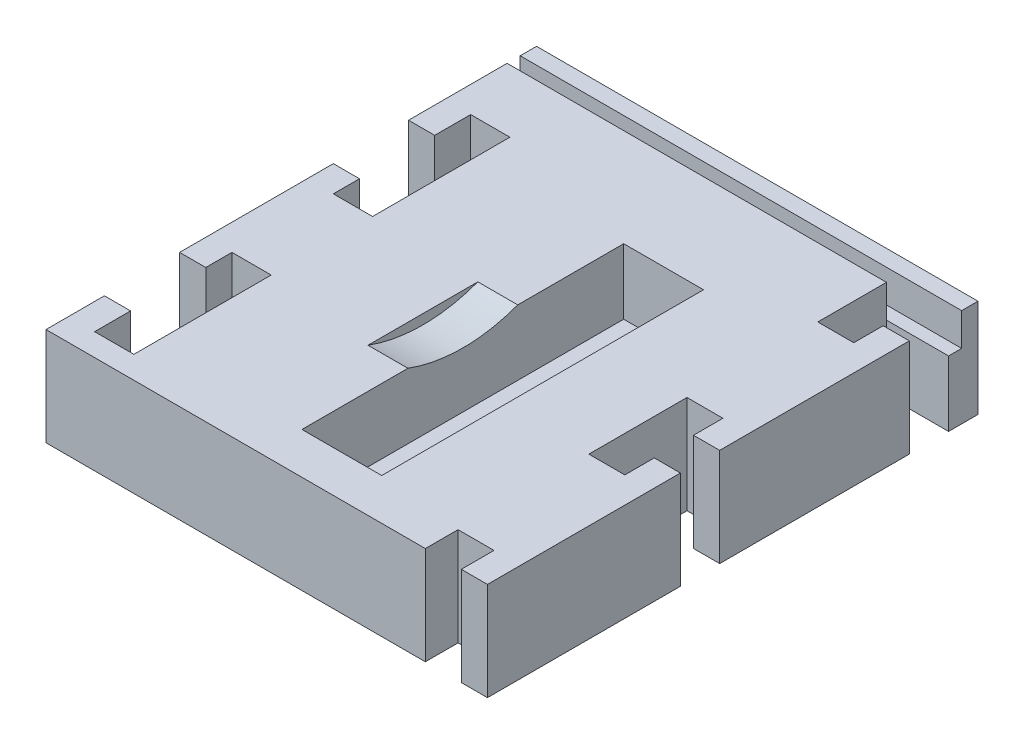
ISO-10303-21;
HEADER;
FILE_DESCRIPTION(('STEP AP214'),'2;1');
FILE_NAME('part.step','',(''),(''),'','','');
FILE_SCHEMA(('AUTOMOTIVE_DESIGN { 1 0 10303 214 1 1 1 1 }'));
ENDSEC;
DATA;
#1=APPLICATION_CONTEXT('core data for automotive mechanical design processes');
#2=APPLICATION_PROTOCOL_DEFINITION('international standard','automotive_design',2000,#1);
#3=PRODUCT_CONTEXT('',#1,'mechanical');
#4=PRODUCT('Part','Part','',(#3));
#5=PRODUCT_RELATED_PRODUCT_CATEGORY('part','',(#4));
#6=PRODUCT_DEFINITION_FORMATION('','',#4);
#7=PRODUCT_DEFINITION_CONTEXT('part definition',#1,'design');
#8=PRODUCT_DEFINITION('design','',#6,#7);
#9=PRODUCT_DEFINITION_SHAPE('','',#8);
#10=(LENGTH_UNIT() NAMED_UNIT(*) SI_UNIT(.MILLI.,.METRE.));
#11=(NAMED_UNIT(*) PLANE_ANGLE_UNIT() SI_UNIT($,.RADIAN.));
#12=(NAMED_UNIT(*) SI_UNIT($,.STERADIAN.) SOLID_ANGLE_UNIT());
#13=UNCERTAINTY_MEASURE_WITH_UNIT(LENGTH_MEASURE(1.E-05),#10,'distance_accuracy_value','');
#14=(GEOMETRIC_REPRESENTATION_CONTEXT(3) GLOBAL_UNCERTAINTY_ASSIGNED_CONTEXT((#13)) GLOBAL_UNIT_ASSIGNED_CONTEXT((#10,
#11,#12)) REPRESENTATION_CONTEXT('',''));
#15=CARTESIAN_POINT('',(0.,0.,0.));
#16=DIRECTION('',(0.,0.,1.));
#17=DIRECTION('',(1.,0.,0.));
#18=AXIS2_PLACEMENT_3D('',#15,#16,#17);
#19=CARTESIAN_POINT('',(0.,15.,0.));
#20=DIRECTION('',(0.,1.,0.));
#21=DIRECTION('',(0.,0.,1.));
#22=AXIS2_PLACEMENT_3D('',#19,#20,#21);
#23=PLANE('',#22);
#24=DIRECTION('',(-1.,0.,0.));
#25=VECTOR('',#24,1.);
#26=CARTESIAN_POINT('',(0.,15.,75.002781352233));
#27=LINE('',#26,#25);
#28=CARTESIAN_POINT('',(58.,15.,75.002781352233));
#29=VERTEX_POINT('',#28);
#30=CARTESIAN_POINT('',(0.,15.,75.002781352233));
#31=VERTEX_POINT('',#30);
#32=EDGE_CURVE('E336',#29,#31,#27,.T.);
#33=ORIENTED_EDGE('',*,*,#32,.F.);
#34=DIRECTION('',(0.,0.,-1.));
#35=VECTOR('',#34,1.);
#36=CARTESIAN_POINT('',(58.,15.,0.));
#37=LINE('',#36,#35);
#38=CARTESIAN_POINT('',(58.,15.,70.002781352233));
#39=VERTEX_POINT('',#38);
#40=EDGE_CURVE('E648',#29,#39,#37,.T.);
#41=ORIENTED_EDGE('',*,*,#40,.T.);
#42=DIRECTION('',(1.,0.,0.));
#43=VECTOR('',#42,1.);
#44=CARTESIAN_POINT('',(0.,15.,70.002781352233));
#45=LINE('',#44,#43);
#46=CARTESIAN_POINT('',(63.5,15.,70.002781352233));
#47=VERTEX_POINT('',#46);
#48=EDGE_CURVE('E558',#39,#47,#45,.T.);
#49=ORIENTED_EDGE('',*,*,#48,.T.);
#50=DIRECTION('',(0.,0.,1.));
#51=VECTOR('',#50,1.);
#52=CARTESIAN_POINT('',(63.5,15.,0.));
#53=LINE('',#52,#51);
#54=CARTESIAN_POINT('',(63.5,15.,75.002781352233));
#55=VERTEX_POINT('',#54);
#56=EDGE_CURVE('E561',#47,#55,#53,.T.);
#57=ORIENTED_EDGE('',*,*,#56,.T.);
#58=DIRECTION('',(1.,0.,0.));
#59=VECTOR('',#58,1.);
#60=CARTESIAN_POINT('',(0.,15.,75.002781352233));
#61=LINE('',#60,#59);
#62=CARTESIAN_POINT('',(67.5,15.,75.002781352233));
#63=VERTEX_POINT('',#62);
#64=EDGE_CURVE('E531',#55,#63,#61,.T.);
#65=ORIENTED_EDGE('',*,*,#64,.T.);
#66=DIRECTION('',(0.,0.,-1.));
#67=VECTOR('',#66,1.);
#68=CARTESIAN_POINT('',(67.5,15.,0.));
#69=LINE('',#68,#67);
#70=CARTESIAN_POINT('',(67.5,15.,45.5027813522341));
#71=VERTEX_POINT('',#70);
#72=EDGE_CURVE('E511',#63,#71,#69,.T.);
#73=ORIENTED_EDGE('',*,*,#72,.T.);
#74=DIRECTION('',(-1.,0.,-2.70616862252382E-13));
#75=VECTOR('',#74,1.);
#76=CARTESIAN_POINT('',(-1.23138199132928E-11,15.,45.5027813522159));
#77=LINE('',#76,#75);
#78=CARTESIAN_POINT('',(63.5,15.,45.502781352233));
#79=VERTEX_POINT('',#78);
#80=EDGE_CURVE('E550',#71,#79,#77,.T.);
#81=ORIENTED_EDGE('',*,*,#80,.T.);
#82=DIRECTION('',(0.,0.,-1.));
#83=VECTOR('',#82,1.);
#84=CARTESIAN_POINT('',(63.5,15.,0.));
#85=LINE('',#84,#83);
#86=CARTESIAN_POINT('',(63.5,15.,50.002781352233));
#87=VERTEX_POINT('',#86);
#88=EDGE_CURVE('E553',#87,#79,#85,.T.);
#89=ORIENTED_EDGE('',*,*,#88,.F.);
#90=DIRECTION('',(1.,0.,0.));
#91=VECTOR('',#90,1.);
#92=CARTESIAN_POINT('',(0.,15.,50.002781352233));
#93=LINE('',#92,#91);
#94=CARTESIAN_POINT('',(58.,15.,50.002781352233));
#95=VERTEX_POINT('',#94);
#96=EDGE_CURVE('E556',#95,#87,#93,.T.);
#97=ORIENTED_EDGE('',*,*,#96,.F.);
#98=CARTESIAN_POINT('',(58.,15.,35.));
#99=VERTEX_POINT('',#98);
#100=EDGE_CURVE('E649',#95,#99,#37,.T.);
#101=ORIENTED_EDGE('',*,*,#100,.T.);
#102=DIRECTION('',(-1.,0.,0.));
#103=VECTOR('',#102,1.);
#104=CARTESIAN_POINT('',(0.,15.,35.));
#105=LINE('',#104,#103);
#106=CARTESIAN_POINT('',(63.5,15.,35.));
#107=VERTEX_POINT('',#106);
#108=EDGE_CURVE('E501',#107,#99,#105,.T.);
#109=ORIENTED_EDGE('',*,*,#108,.F.);
#110=DIRECTION('',(0.,0.,1.));
#111=VECTOR('',#110,1.);
#112=CARTESIAN_POINT('',(63.5,15.,0.));
#113=LINE('',#112,#111);
#114=CARTESIAN_POINT('',(63.5,15.,39.5));
#115=VERTEX_POINT('',#114);
#116=EDGE_CURVE('E504',#107,#115,#113,.T.);
#117=ORIENTED_EDGE('',*,*,#116,.T.);
#118=DIRECTION('',(1.,0.,0.));
#119=VECTOR('',#118,1.);
#120=CARTESIAN_POINT('',(0.,15.,39.5));
#121=LINE('',#120,#119);
#122=CARTESIAN_POINT('',(67.5,15.,39.5));
#123=VERTEX_POINT('',#122);
#124=EDGE_CURVE('E474',#115,#123,#121,.T.);
#125=ORIENTED_EDGE('',*,*,#124,.T.);
#126=DIRECTION('',(0.,0.,1.));
#127=VECTOR('',#126,1.);
#128=CARTESIAN_POINT('',(67.5,15.,0.));
#129=LINE('',#128,#127);
#130=CARTESIAN_POINT('',(67.5,15.,10.5));
#131=VERTEX_POINT('',#130);
#132=EDGE_CURVE('E465',#131,#123,#129,.T.);
#133=ORIENTED_EDGE('',*,*,#132,.F.);
#134=DIRECTION('',(-1.,0.,0.));
#135=VECTOR('',#134,1.);
#136=CARTESIAN_POINT('',(0.,15.,10.5));
#137=LINE('',#136,#135);
#138=CARTESIAN_POINT('',(63.5,15.,10.5));
#139=VERTEX_POINT('',#138);
#140=EDGE_CURVE('E493',#131,#139,#137,.T.);
#141=ORIENTED_EDGE('',*,*,#140,.T.);
#142=DIRECTION('',(0.,0.,-1.));
#143=VECTOR('',#142,1.);
#144=CARTESIAN_POINT('',(63.5,15.,0.));
#145=LINE('',#144,#143);
#146=CARTESIAN_POINT('',(63.5,15.,15.));
#147=VERTEX_POINT('',#146);
#148=EDGE_CURVE('E496',#147,#139,#145,.T.);
#149=ORIENTED_EDGE('',*,*,#148,.F.);
#150=DIRECTION('',(1.,0.,0.));
#151=VECTOR('',#150,1.);
#152=CARTESIAN_POINT('',(0.,15.,15.));
#153=LINE('',#152,#151);
#154=CARTESIAN_POINT('',(58.,15.,15.));
#155=VERTEX_POINT('',#154);
#156=EDGE_CURVE('E499',#155,#147,#153,.T.);
#157=ORIENTED_EDGE('',*,*,#156,.F.);
#158=CARTESIAN_POINT('',(58.,15.,4.5));
#159=VERTEX_POINT('',#158);
#160=EDGE_CURVE('E367',#155,#159,#37,.T.);
#161=ORIENTED_EDGE('',*,*,#160,.T.);
#162=DIRECTION('',(1.,0.,0.));
#163=VECTOR('',#162,1.);
#164=CARTESIAN_POINT('',(67.5,15.,4.5));
#165=LINE('',#164,#163);
#166=CARTESIAN_POINT('',(0.,15.,4.5));
#167=VERTEX_POINT('',#166);
#168=EDGE_CURVE('E375',#167,#159,#165,.T.);
#169=ORIENTED_EDGE('',*,*,#168,.F.);
#170=DIRECTION('',(0.,0.,1.));
#171=VECTOR('',#170,1.);
#172=CARTESIAN_POINT('',(0.,15.,0.));
#173=LINE('',#172,#171);
#174=CARTESIAN_POINT('',(0.,15.,19.5705115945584));
#175=VERTEX_POINT('',#174);
#176=EDGE_CURVE('E362',#167,#175,#173,.T.);
#177=ORIENTED_EDGE('',*,*,#176,.T.);
#178=DIRECTION('',(-1.,0.,0.));
#179=VECTOR('',#178,1.);
#180=CARTESIAN_POINT('',(4.,15.,19.5705115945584));
#181=LINE('',#180,#179);
#182=CARTESIAN_POINT('',(4.,15.,19.5705115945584));
#183=VERTEX_POINT('',#182);
#184=EDGE_CURVE('E373',#183,#175,#181,.T.);
#185=ORIENTED_EDGE('',*,*,#184,.F.);
#186=DIRECTION('',(0.,0.,1.));
#187=VECTOR('',#186,1.);
#188=CARTESIAN_POINT('',(4.,15.,14.0705115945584));
#189=LINE('',#188,#187);
#190=CARTESIAN_POINT('',(4.,15.,14.0705115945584));
#191=VERTEX_POINT('',#190);
#192=EDGE_CURVE('E387',#191,#183,#189,.T.);
#193=ORIENTED_EDGE('',*,*,#192,.F.);
#194=DIRECTION('',(-1.,0.,0.));
#195=VECTOR('',#194,1.);
#196=CARTESIAN_POINT('',(4.,15.,14.0705115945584));
#197=LINE('',#196,#195);
#198=CARTESIAN_POINT('',(10.,15.,14.0705115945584));
#199=VERTEX_POINT('',#198);
#200=EDGE_CURVE('E717',#199,#191,#197,.T.);
#201=ORIENTED_EDGE('',*,*,#200,.F.);
#202=DIRECTION('',(0.,0.,-1.));
#203=VECTOR('',#202,1.);
#204=CARTESIAN_POINT('',(10.,15.,14.0705115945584));
#205=LINE('',#204,#203);
#206=CARTESIAN_POINT('',(10.,15.,35.0705115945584));
#207=VERTEX_POINT('',#206);
#208=EDGE_CURVE('E714',#207,#199,#205,.T.);
#209=ORIENTED_EDGE('',*,*,#208,.F.);
#210=DIRECTION('',(1.,0.,0.));
#211=VECTOR('',#210,1.);
#212=CARTESIAN_POINT('',(4.00000000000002,15.,35.0705115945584));
#213=LINE('',#212,#211);
#214=CARTESIAN_POINT('',(4.00000000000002,15.,35.0705115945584));
#215=VERTEX_POINT('',#214);
#216=EDGE_CURVE('E711',#215,#207,#213,.T.);
#217=ORIENTED_EDGE('',*,*,#216,.F.);
#218=DIRECTION('',(0.,0.,1.));
#219=VECTOR('',#218,1.);
#220=CARTESIAN_POINT('',(4.00000000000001,15.,29.5705115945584));
#221=LINE('',#220,#219);
#222=CARTESIAN_POINT('',(4.00000000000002,15.,31.0705115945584));
#223=VERTEX_POINT('',#222);
#224=EDGE_CURVE('E695',#223,#215,#221,.T.);
#225=ORIENTED_EDGE('',*,*,#224,.F.);
#226=DIRECTION('',(1.,0.,0.));
#227=VECTOR('',#226,1.);
#228=CARTESIAN_POINT('',(4.00000000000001,15.,31.0705115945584));
#229=LINE('',#228,#227);
#230=CARTESIAN_POINT('',(0.,15.,31.0705115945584));
#231=VERTEX_POINT('',#230);
#232=EDGE_CURVE('E59',#231,#223,#229,.T.);
#233=ORIENTED_EDGE('',*,*,#232,.F.);
#234=CARTESIAN_POINT('',(0.,15.,54.5713782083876));
#235=VERTEX_POINT('',#234);
#236=EDGE_CURVE('E358',#231,#235,#173,.T.);
#237=ORIENTED_EDGE('',*,*,#236,.T.);
#238=DIRECTION('',(-1.,0.,0.));
#239=VECTOR('',#238,1.);
#240=CARTESIAN_POINT('',(4.,15.,54.5713782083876));
#241=LINE('',#240,#239);
#242=CARTESIAN_POINT('',(4.,15.,54.5713782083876));
#243=VERTEX_POINT('',#242);
#244=EDGE_CURVE('E742',#243,#235,#241,.T.);
#245=ORIENTED_EDGE('',*,*,#244,.F.);
#246=DIRECTION('',(0.,0.,1.));
#247=VECTOR('',#246,1.);
#248=CARTESIAN_POINT('',(4.,15.,56.0713782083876));
#249=LINE('',#248,#247);
#250=CARTESIAN_POINT('',(4.,15.,50.5705115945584));
#251=VERTEX_POINT('',#250);
#252=EDGE_CURVE('E413',#251,#243,#249,.T.);
#253=ORIENTED_EDGE('',*,*,#252,.F.);
#254=DIRECTION('',(-1.,0.,0.));
#255=VECTOR('',#254,1.);
#256=CARTESIAN_POINT('',(10.,15.,50.5705115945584));
#257=LINE('',#256,#255);
#258=CARTESIAN_POINT('',(10.,15.,50.5705115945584));
#259=VERTEX_POINT('',#258);
#260=EDGE_CURVE('E437',#259,#251,#257,.T.);
#261=ORIENTED_EDGE('',*,*,#260,.F.);
#262=DIRECTION('',(0.,0.,-1.));
#263=VECTOR('',#262,1.);
#264=CARTESIAN_POINT('',(10.,15.,50.5705115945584));
#265=LINE('',#264,#263);
#266=CARTESIAN_POINT('',(10.,15.,71.5705115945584));
#267=VERTEX_POINT('',#266);
#268=EDGE_CURVE('E434',#267,#259,#265,.T.);
#269=ORIENTED_EDGE('',*,*,#268,.F.);
#270=DIRECTION('',(1.,0.,0.));
#271=VECTOR('',#270,1.);
#272=CARTESIAN_POINT('',(10.,15.,71.5705115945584));
#273=LINE('',#272,#271);
#274=CARTESIAN_POINT('',(4.,15.,71.5705115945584));
#275=VERTEX_POINT('',#274);
#276=EDGE_CURVE('E431',#275,#267,#273,.T.);
#277=ORIENTED_EDGE('',*,*,#276,.F.);
#278=DIRECTION('',(0.,0.,1.));
#279=VECTOR('',#278,1.);
#280=CARTESIAN_POINT('',(4.,15.,66.0705115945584));
#281=LINE('',#280,#279);
#282=CARTESIAN_POINT('',(4.,15.,66.0705115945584));
#283=VERTEX_POINT('',#282);
#284=EDGE_CURVE('E394',#283,#275,#281,.T.);
#285=ORIENTED_EDGE('',*,*,#284,.F.);
#286=DIRECTION('',(1.,0.,0.));
#287=VECTOR('',#286,1.);
#288=CARTESIAN_POINT('',(4.,15.,66.0705115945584));
#289=LINE('',#288,#287);
#290=CARTESIAN_POINT('',(0.,15.,66.0705115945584));
#291=VERTEX_POINT('',#290);
#292=EDGE_CURVE('E357',#291,#283,#289,.T.);
#293=ORIENTED_EDGE('',*,*,#292,.F.);
#294=EDGE_CURVE('E349',#291,#31,#173,.T.);
#295=ORIENTED_EDGE('',*,*,#294,.T.);
#296=EDGE_LOOP('',(#33,#41,#49,#57,#65,#73,#81,#89,#97,#101,#109,#117,#125,#133,#141,#149,#157,
#161,#169,#177,#185,#193,#201,#209,#217,#225,#233,#237,#245,#253,#261,#269,#277,#285,#293,#295));
#297=FACE_BOUND('',#296,.T.);
#298=DIRECTION('',(1.,0.,0.));
#299=VECTOR('',#298,1.);
#300=CARTESIAN_POINT('',(27.6,15.,52.4670525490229));
#301=LINE('',#300,#299);
#302=CARTESIAN_POINT('',(26.7,15.,52.4670525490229));
#303=VERTEX_POINT('',#302);
#304=CARTESIAN_POINT('',(32.8,15.,52.4670525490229));
#305=VERTEX_POINT('',#304);
#306=EDGE_CURVE('E619',#303,#305,#301,.T.);
#307=ORIENTED_EDGE('',*,*,#306,.F.);
#308=DIRECTION('',(0.,0.,1.));
#309=VECTOR('',#308,1.);
#310=CARTESIAN_POINT('',(26.7,15.,52.4670525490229));
#311=LINE('',#310,#309);
#312=CARTESIAN_POINT('',(26.7,15.,35.6739706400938));
#313=VERTEX_POINT('',#312);
#314=EDGE_CURVE('E806',#313,#303,#311,.T.);
#315=ORIENTED_EDGE('',*,*,#314,.F.);
#316=DIRECTION('',(1.,0.,0.));
#317=VECTOR('',#316,1.);
#318=CARTESIAN_POINT('',(27.6,15.,35.6739706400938));
#319=LINE('',#318,#317);
#320=CARTESIAN_POINT('',(32.8,15.,35.6739706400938));
#321=VERTEX_POINT('',#320);
#322=EDGE_CURVE('E618',#321,#313,#319,.F.);
#323=ORIENTED_EDGE('',*,*,#322,.F.);
#324=DIRECTION('',(0.,0.,1.));
#325=VECTOR('',#324,1.);
#326=CARTESIAN_POINT('',(32.8,15.,44.0705115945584));
#327=LINE('',#326,#325);
#328=CARTESIAN_POINT('',(32.8,15.,19.4705115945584));
#329=VERTEX_POINT('',#328);
#330=EDGE_CURVE('E588',#329,#321,#327,.T.);
#331=ORIENTED_EDGE('',*,*,#330,.F.);
#332=DIRECTION('',(-1.,0.,0.));
#333=VECTOR('',#332,1.);
#334=CARTESIAN_POINT('',(45.,15.,19.4705115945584));
#335=LINE('',#334,#333);
#336=CARTESIAN_POINT('',(45.,15.,19.4705115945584));
#337=VERTEX_POINT('',#336);
#338=EDGE_CURVE('E602',#337,#329,#335,.T.);
#339=ORIENTED_EDGE('',*,*,#338,.F.);
#340=DIRECTION('',(0.,0.,-1.));
#341=VECTOR('',#340,1.);
#342=CARTESIAN_POINT('',(45.,15.,19.4705115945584));
#343=LINE('',#342,#341);
#344=CARTESIAN_POINT('',(45.,15.,68.6705115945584));
#345=VERTEX_POINT('',#344);
#346=EDGE_CURVE('E599',#345,#337,#343,.T.);
#347=ORIENTED_EDGE('',*,*,#346,.F.);
#348=DIRECTION('',(1.,0.,0.));
#349=VECTOR('',#348,1.);
#350=CARTESIAN_POINT('',(32.8,15.,68.6705115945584));
#351=LINE('',#350,#349);
#352=CARTESIAN_POINT('',(32.8,15.,68.6705115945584));
#353=VERTEX_POINT('',#352);
#354=EDGE_CURVE('E568',#353,#345,#351,.T.);
#355=ORIENTED_EDGE('',*,*,#354,.F.);
#356=EDGE_CURVE('E604',#305,#353,#327,.T.);
#357=ORIENTED_EDGE('',*,*,#356,.F.);
#358=EDGE_LOOP('',(#307,#315,#323,#331,#339,#347,#355,#357));
#359=FACE_BOUND('',#358,.T.);
#360=ADVANCED_FACE('F36',(#297,#359),#23,.T.);
#361=CARTESIAN_POINT('',(0.,15.,0.));
#362=DIRECTION('',(1.,0.,0.));
#363=DIRECTION('',(0.,0.,-1.));
#364=AXIS2_PLACEMENT_3D('',#361,#362,#363);
#365=PLANE('',#364);
#366=ORIENTED_EDGE('',*,*,#236,.F.);
#367=DIRECTION('',(0.,1.,0.));
#368=VECTOR('',#367,1.);
#369=CARTESIAN_POINT('',(0.,0.,31.0705115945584));
#370=LINE('',#369,#368);
#371=CARTESIAN_POINT('',(0.,0.,31.0705115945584));
#372=VERTEX_POINT('',#371);
#373=EDGE_CURVE('E743',#372,#231,#370,.T.);
#374=ORIENTED_EDGE('',*,*,#373,.F.);
#375=DIRECTION('',(0.,0.,1.));
#376=VECTOR('',#375,1.);
#377=CARTESIAN_POINT('',(0.,0.,0.));
#378=LINE('',#377,#376);
#379=CARTESIAN_POINT('',(0.,0.,54.5713782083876));
#380=VERTEX_POINT('',#379);
#381=EDGE_CURVE('E623',#372,#380,#378,.T.);
#382=ORIENTED_EDGE('',*,*,#381,.T.);
#383=DIRECTION('',(0.,1.,0.));
#384=VECTOR('',#383,1.);
#385=CARTESIAN_POINT('',(0.,0.,54.5713782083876));
#386=LINE('',#385,#384);
#387=EDGE_CURVE('E685',#380,#235,#386,.T.);
#388=ORIENTED_EDGE('',*,*,#387,.T.);
#389=EDGE_LOOP('',(#366,#374,#382,#388));
#390=FACE_BOUND('',#389,.T.);
#391=ADVANCED_FACE('F779',(#390),#365,.F.);
#392=ORIENTED_EDGE('',*,*,#176,.F.);
#393=DIRECTION('',(0.,1.,0.));
#394=VECTOR('',#393,1.);
#395=CARTESIAN_POINT('',(0.,10.,4.5));
#396=LINE('',#395,#394);
#397=CARTESIAN_POINT('',(0.,10.,4.5));
#398=VERTEX_POINT('',#397);
#399=EDGE_CURVE('E688',#398,#167,#396,.T.);
#400=ORIENTED_EDGE('',*,*,#399,.F.);
#401=DIRECTION('',(0.,0.,1.));
#402=VECTOR('',#401,1.);
#403=CARTESIAN_POINT('',(0.,10.,4.5));
#404=LINE('',#403,#402);
#405=CARTESIAN_POINT('',(0.,10.,2.50000000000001));
#406=VERTEX_POINT('',#405);
#407=EDGE_CURVE('E676',#406,#398,#404,.T.);
#408=ORIENTED_EDGE('',*,*,#407,.F.);
#409=DIRECTION('',(0.,1.,0.));
#410=VECTOR('',#409,1.);
#411=CARTESIAN_POINT('',(0.,10.,2.50000000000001));
#412=LINE('',#411,#410);
#413=CARTESIAN_POINT('',(0.,15.,2.50000000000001));
#414=VERTEX_POINT('',#413);
#415=EDGE_CURVE('E690',#406,#414,#412,.T.);
#416=ORIENTED_EDGE('',*,*,#415,.T.);
#417=CARTESIAN_POINT('',(0.,15.,0.));
#418=VERTEX_POINT('',#417);
#419=EDGE_CURVE('E361',#418,#414,#173,.T.);
#420=ORIENTED_EDGE('',*,*,#419,.F.);
#421=DIRECTION('',(0.,-1.,0.));
#422=VECTOR('',#421,1.);
#423=CARTESIAN_POINT('',(0.,15.,0.));
#424=LINE('',#423,#422);
#425=CARTESIAN_POINT('',(0.,0.,0.));
#426=VERTEX_POINT('',#425);
#427=EDGE_CURVE('E11',#418,#426,#424,.T.);
#428=ORIENTED_EDGE('',*,*,#427,.T.);
#429=CARTESIAN_POINT('',(0.,0.,19.5705115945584));
#430=VERTEX_POINT('',#429);
#431=EDGE_CURVE('E392',#426,#430,#378,.T.);
#432=ORIENTED_EDGE('',*,*,#431,.T.);
#433=DIRECTION('',(0.,1.,0.));
#434=VECTOR('',#433,1.);
#435=CARTESIAN_POINT('',(0.,0.,19.5705115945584));
#436=LINE('',#435,#434);
#437=EDGE_CURVE('E382',#430,#175,#436,.T.);
#438=ORIENTED_EDGE('',*,*,#437,.T.);
#439=EDGE_LOOP('',(#392,#400,#408,#416,#420,#428,#432,#438));
#440=FACE_BOUND('',#439,.T.);
#441=ADVANCED_FACE('F390',(#440),#365,.F.);
#442=CARTESIAN_POINT('',(58.,15.,0.));
#443=DIRECTION('',(-1.,0.,0.));
#444=DIRECTION('',(0.,0.,1.));
#445=AXIS2_PLACEMENT_3D('',#442,#443,#444);
#446=PLANE('',#445);
#447=DIRECTION('',(0.,1.,0.));
#448=VECTOR('',#447,1.);
#449=CARTESIAN_POINT('',(58.,0.,4.5));
#450=LINE('',#449,#448);
#451=CARTESIAN_POINT('',(58.,0.,4.5));
#452=VERTEX_POINT('',#451);
#453=CARTESIAN_POINT('',(58.,10.,4.5));
#454=VERTEX_POINT('',#453);
#455=EDGE_CURVE('E462',#452,#454,#450,.T.);
#456=ORIENTED_EDGE('',*,*,#455,.T.);
#457=DIRECTION('',(0.,1.,0.));
#458=VECTOR('',#457,1.);
#459=CARTESIAN_POINT('',(58.,15.,4.5));
#460=LINE('',#459,#458);
#461=EDGE_CURVE('E656',#454,#159,#460,.T.);
#462=ORIENTED_EDGE('',*,*,#461,.T.);
#463=ORIENTED_EDGE('',*,*,#160,.F.);
#464=DIRECTION('',(0.,1.,0.));
#465=VECTOR('',#464,1.);
#466=CARTESIAN_POINT('',(58.,0.,15.));
#467=LINE('',#466,#465);
#468=CARTESIAN_POINT('',(58.,0.,15.));
#469=VERTEX_POINT('',#468);
#470=EDGE_CURVE('E518',#469,#155,#467,.T.);
#471=ORIENTED_EDGE('',*,*,#470,.F.);
#472=DIRECTION('',(0.,0.,-1.));
#473=VECTOR('',#472,1.);
#474=CARTESIAN_POINT('',(58.,0.,0.));
#475=LINE('',#474,#473);
#476=EDGE_CURVE('E627',#469,#452,#475,.T.);
#477=ORIENTED_EDGE('',*,*,#476,.T.);
#478=EDGE_LOOP('',(#456,#462,#463,#471,#477));
#479=FACE_BOUND('',#478,.T.);
#480=ADVANCED_FACE('F654',(#479),#446,.F.);
#481=DIRECTION('',(0.,1.,0.));
#482=VECTOR('',#481,1.);
#483=CARTESIAN_POINT('',(58.,0.,35.));
#484=LINE('',#483,#482);
#485=CARTESIAN_POINT('',(58.,0.,35.));
#486=VERTEX_POINT('',#485);
#487=EDGE_CURVE('E516',#486,#99,#484,.T.);
#488=ORIENTED_EDGE('',*,*,#487,.T.);
#489=ORIENTED_EDGE('',*,*,#100,.F.);
#490=DIRECTION('',(0.,1.,0.));
#491=VECTOR('',#490,1.);
#492=CARTESIAN_POINT('',(58.,0.,50.002781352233));
#493=LINE('',#492,#491);
#494=CARTESIAN_POINT('',(58.,0.,50.002781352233));
#495=VERTEX_POINT('',#494);
#496=EDGE_CURVE('E576',#495,#95,#493,.T.);
#497=ORIENTED_EDGE('',*,*,#496,.F.);
#498=EDGE_CURVE('E628',#495,#486,#475,.T.);
#499=ORIENTED_EDGE('',*,*,#498,.T.);
#500=EDGE_LOOP('',(#488,#489,#497,#499));
#501=FACE_BOUND('',#500,.T.);
#502=ADVANCED_FACE('F904',(#501),#446,.F.);
#503=CARTESIAN_POINT('',(0.,0.,66.0705115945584));
#504=VERTEX_POINT('',#503);
#505=CARTESIAN_POINT('',(0.,0.,75.002781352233));
#506=VERTEX_POINT('',#505);
#507=EDGE_CURVE('E351',#504,#506,#378,.T.);
#508=ORIENTED_EDGE('',*,*,#507,.T.);
#509=DIRECTION('',(0.,1.,0.));
#510=VECTOR('',#509,1.);
#511=CARTESIAN_POINT('',(0.,0.,75.002781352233));
#512=LINE('',#511,#510);
#513=EDGE_CURVE('E51',#506,#31,#512,.T.);
#514=ORIENTED_EDGE('',*,*,#513,.T.);
#515=ORIENTED_EDGE('',*,*,#294,.F.);
#516=DIRECTION('',(0.,1.,0.));
#517=VECTOR('',#516,1.);
#518=CARTESIAN_POINT('',(0.,0.,66.0705115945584));
#519=LINE('',#518,#517);
#520=EDGE_CURVE('E427',#504,#291,#519,.T.);
#521=ORIENTED_EDGE('',*,*,#520,.F.);
#522=EDGE_LOOP('',(#508,#514,#515,#521));
#523=FACE_BOUND('',#522,.T.);
#524=ADVANCED_FACE('F38',(#523),#365,.F.);
#525=ORIENTED_EDGE('',*,*,#40,.F.);
#526=DIRECTION('',(0.,-1.,0.));
#527=VECTOR('',#526,1.);
#528=CARTESIAN_POINT('',(58.,15.,75.002781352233));
#529=LINE('',#528,#527);
#530=CARTESIAN_POINT('',(58.,0.,75.002781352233));
#531=VERTEX_POINT('',#530);
#532=EDGE_CURVE('E339',#29,#531,#529,.T.);
#533=ORIENTED_EDGE('',*,*,#532,.T.);
#534=CARTESIAN_POINT('',(58.,0.,70.002781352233));
#535=VERTEX_POINT('',#534);
#536=EDGE_CURVE('E363',#531,#535,#475,.T.);
#537=ORIENTED_EDGE('',*,*,#536,.T.);
#538=DIRECTION('',(0.,1.,0.));
#539=VECTOR('',#538,1.);
#540=CARTESIAN_POINT('',(58.,0.,70.002781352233));
#541=LINE('',#540,#539);
#542=EDGE_CURVE('E573',#535,#39,#541,.T.);
#543=ORIENTED_EDGE('',*,*,#542,.T.);
#544=EDGE_LOOP('',(#525,#533,#537,#543));
#545=FACE_BOUND('',#544,.T.);
#546=ADVANCED_FACE('F634',(#545),#446,.F.);
#547=CARTESIAN_POINT('',(0.,15.,0.));
#548=DIRECTION('',(0.,0.,1.));
#549=DIRECTION('',(1.,0.,0.));
#550=AXIS2_PLACEMENT_3D('',#547,#548,#549);
#551=PLANE('',#550);
#552=DIRECTION('',(-1.,0.,0.));
#553=VECTOR('',#552,1.);
#554=CARTESIAN_POINT('',(0.,0.,0.));
#555=LINE('',#554,#553);
#556=CARTESIAN_POINT('',(67.5,0.,0.));
#557=VERTEX_POINT('',#556);
#558=EDGE_CURVE('E359',#557,#426,#555,.T.);
#559=ORIENTED_EDGE('',*,*,#558,.T.);
#560=ORIENTED_EDGE('',*,*,#427,.F.);
#561=DIRECTION('',(-1.,0.,0.));
#562=VECTOR('',#561,1.);
#563=CARTESIAN_POINT('',(0.,15.,0.));
#564=LINE('',#563,#562);
#565=CARTESIAN_POINT('',(67.5,15.,0.));
#566=VERTEX_POINT('',#565);
#567=EDGE_CURVE('E44',#566,#418,#564,.T.);
#568=ORIENTED_EDGE('',*,*,#567,.F.);
#569=DIRECTION('',(0.,1.,0.));
#570=VECTOR('',#569,1.);
#571=CARTESIAN_POINT('',(67.5,0.,0.));
#572=LINE('',#571,#570);
#573=EDGE_CURVE('E466',#557,#566,#572,.T.);
#574=ORIENTED_EDGE('',*,*,#573,.F.);
#575=EDGE_LOOP('',(#559,#560,#568,#574));
#576=FACE_BOUND('',#575,.T.);
#577=ADVANCED_FACE('F789',(#576),#551,.F.);
#578=DIRECTION('',(-1.,0.,0.));
#579=VECTOR('',#578,1.);
#580=CARTESIAN_POINT('',(0.,15.,2.50000000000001));
#581=LINE('',#580,#579);
#582=CARTESIAN_POINT('',(67.5,15.,2.50000000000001));
#583=VERTEX_POINT('',#582);
#584=EDGE_CURVE('E683',#583,#414,#581,.T.);
#585=ORIENTED_EDGE('',*,*,#584,.F.);
#586=DIRECTION('',(0.,0.,1.));
#587=VECTOR('',#586,1.);
#588=CARTESIAN_POINT('',(67.5,15.,0.));
#589=LINE('',#588,#587);
#590=EDGE_CURVE('E444',#566,#583,#589,.T.);
#591=ORIENTED_EDGE('',*,*,#590,.F.);
#592=ORIENTED_EDGE('',*,*,#567,.T.);
#593=ORIENTED_EDGE('',*,*,#419,.T.);
#594=EDGE_LOOP('',(#585,#591,#592,#593));
#595=FACE_BOUND('',#594,.T.);
#596=ADVANCED_FACE('F781',(#595),#23,.T.);
#597=CARTESIAN_POINT('',(0.,0.,0.));
#598=DIRECTION('',(0.,1.,0.));
#599=DIRECTION('',(0.,0.,1.));
#600=AXIS2_PLACEMENT_3D('',#597,#598,#599);
#601=PLANE('',#600);
#602=ORIENTED_EDGE('',*,*,#536,.F.);
#603=DIRECTION('',(-1.,0.,0.));
#604=VECTOR('',#603,1.);
#605=CARTESIAN_POINT('',(0.,0.,75.002781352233));
#606=LINE('',#605,#604);
#607=EDGE_CURVE('E343',#531,#506,#606,.T.);
#608=ORIENTED_EDGE('',*,*,#607,.T.);
#609=ORIENTED_EDGE('',*,*,#507,.F.);
#610=DIRECTION('',(1.,0.,0.));
#611=VECTOR('',#610,1.);
#612=CARTESIAN_POINT('',(4.,0.,66.0705115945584));
#613=LINE('',#612,#611);
#614=CARTESIAN_POINT('',(4.,0.,66.0705115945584));
#615=VERTEX_POINT('',#614);
#616=EDGE_CURVE('E409',#504,#615,#613,.T.);
#617=ORIENTED_EDGE('',*,*,#616,.T.);
#618=DIRECTION('',(0.,0.,1.));
#619=VECTOR('',#618,1.);
#620=CARTESIAN_POINT('',(4.,0.,66.0705115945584));
#621=LINE('',#620,#619);
#622=CARTESIAN_POINT('',(4.,0.,71.5705115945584));
#623=VERTEX_POINT('',#622);
#624=EDGE_CURVE('E412',#615,#623,#621,.T.);
#625=ORIENTED_EDGE('',*,*,#624,.T.);
#626=DIRECTION('',(1.,0.,0.));
#627=VECTOR('',#626,1.);
#628=CARTESIAN_POINT('',(10.,0.,71.5705115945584));
#629=LINE('',#628,#627);
#630=CARTESIAN_POINT('',(10.,0.,71.5705115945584));
#631=VERTEX_POINT('',#630);
#632=EDGE_CURVE('E416',#623,#631,#629,.T.);
#633=ORIENTED_EDGE('',*,*,#632,.T.);
#634=DIRECTION('',(0.,0.,-1.));
#635=VECTOR('',#634,1.);
#636=CARTESIAN_POINT('',(10.,0.,50.5705115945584));
#637=LINE('',#636,#635);
#638=CARTESIAN_POINT('',(10.,0.,50.5705115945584));
#639=VERTEX_POINT('',#638);
#640=EDGE_CURVE('E419',#631,#639,#637,.T.);
#641=ORIENTED_EDGE('',*,*,#640,.T.);
#642=DIRECTION('',(-1.,0.,0.));
#643=VECTOR('',#642,1.);
#644=CARTESIAN_POINT('',(10.,0.,50.5705115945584));
#645=LINE('',#644,#643);
#646=CARTESIAN_POINT('',(4.,0.,50.5705115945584));
#647=VERTEX_POINT('',#646);
#648=EDGE_CURVE('E422',#639,#647,#645,.T.);
#649=ORIENTED_EDGE('',*,*,#648,.T.);
#650=DIRECTION('',(0.,0.,1.));
#651=VECTOR('',#650,1.);
#652=CARTESIAN_POINT('',(4.,0.,56.0713782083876));
#653=LINE('',#652,#651);
#654=CARTESIAN_POINT('',(4.,0.,54.5713782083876));
#655=VERTEX_POINT('',#654);
#656=EDGE_CURVE('E425',#647,#655,#653,.T.);
#657=ORIENTED_EDGE('',*,*,#656,.T.);
#658=DIRECTION('',(-1.,0.,0.));
#659=VECTOR('',#658,1.);
#660=CARTESIAN_POINT('',(4.,0.,54.5713782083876));
#661=LINE('',#660,#659);
#662=EDGE_CURVE('E746',#655,#380,#661,.T.);
#663=ORIENTED_EDGE('',*,*,#662,.T.);
#664=ORIENTED_EDGE('',*,*,#381,.F.);
#665=DIRECTION('',(1.,0.,0.));
#666=VECTOR('',#665,1.);
#667=CARTESIAN_POINT('',(4.00000000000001,0.,31.0705115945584));
#668=LINE('',#667,#666);
#669=CARTESIAN_POINT('',(4.00000000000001,0.,31.0705115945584));
#670=VERTEX_POINT('',#669);
#671=EDGE_CURVE('E748',#372,#670,#668,.T.);
#672=ORIENTED_EDGE('',*,*,#671,.T.);
#673=DIRECTION('',(0.,0.,1.));
#674=VECTOR('',#673,1.);
#675=CARTESIAN_POINT('',(4.00000000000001,0.,29.5705115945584));
#676=LINE('',#675,#674);
#677=CARTESIAN_POINT('',(4.00000000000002,0.,35.0705115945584));
#678=VERTEX_POINT('',#677);
#679=EDGE_CURVE('E386',#670,#678,#676,.T.);
#680=ORIENTED_EDGE('',*,*,#679,.T.);
#681=DIRECTION('',(1.,0.,0.));
#682=VECTOR('',#681,1.);
#683=CARTESIAN_POINT('',(4.00000000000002,0.,35.0705115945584));
#684=LINE('',#683,#682);
#685=CARTESIAN_POINT('',(10.,0.,35.0705115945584));
#686=VERTEX_POINT('',#685);
#687=EDGE_CURVE('E697',#678,#686,#684,.T.);
#688=ORIENTED_EDGE('',*,*,#687,.T.);
#689=DIRECTION('',(0.,0.,-1.));
#690=VECTOR('',#689,1.);
#691=CARTESIAN_POINT('',(10.,0.,14.0705115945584));
#692=LINE('',#691,#690);
#693=CARTESIAN_POINT('',(10.,0.,14.0705115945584));
#694=VERTEX_POINT('',#693);
#695=EDGE_CURVE('E700',#686,#694,#692,.T.);
#696=ORIENTED_EDGE('',*,*,#695,.T.);
#697=DIRECTION('',(-1.,0.,0.));
#698=VECTOR('',#697,1.);
#699=CARTESIAN_POINT('',(4.,0.,14.0705115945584));
#700=LINE('',#699,#698);
#701=CARTESIAN_POINT('',(4.,0.,14.0705115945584));
#702=VERTEX_POINT('',#701);
#703=EDGE_CURVE('E703',#694,#702,#700,.T.);
#704=ORIENTED_EDGE('',*,*,#703,.T.);
#705=DIRECTION('',(0.,0.,1.));
#706=VECTOR('',#705,1.);
#707=CARTESIAN_POINT('',(4.,0.,14.0705115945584));
#708=LINE('',#707,#706);
#709=CARTESIAN_POINT('',(4.,0.,19.5705115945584));
#710=VERTEX_POINT('',#709);
#711=EDGE_CURVE('E706',#702,#710,#708,.T.);
#712=ORIENTED_EDGE('',*,*,#711,.T.);
#713=DIRECTION('',(-1.,0.,0.));
#714=VECTOR('',#713,1.);
#715=CARTESIAN_POINT('',(4.,0.,19.5705115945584));
#716=LINE('',#715,#714);
#717=EDGE_CURVE('E408',#710,#430,#716,.T.);
#718=ORIENTED_EDGE('',*,*,#717,.T.);
#719=ORIENTED_EDGE('',*,*,#431,.F.);
#720=ORIENTED_EDGE('',*,*,#558,.F.);
#721=DIRECTION('',(0.,0.,1.));
#722=VECTOR('',#721,1.);
#723=CARTESIAN_POINT('',(67.5,0.,0.));
#724=LINE('',#723,#722);
#725=CARTESIAN_POINT('',(67.5,0.,4.5));
#726=VERTEX_POINT('',#725);
#727=EDGE_CURVE('E457',#557,#726,#724,.T.);
#728=ORIENTED_EDGE('',*,*,#727,.T.);
#729=DIRECTION('',(-1.,0.,0.));
#730=VECTOR('',#729,1.);
#731=CARTESIAN_POINT('',(0.,0.,4.50000000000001));
#732=LINE('',#731,#730);
#733=EDGE_CURVE('E454',#726,#452,#732,.T.);
#734=ORIENTED_EDGE('',*,*,#733,.T.);
#735=ORIENTED_EDGE('',*,*,#476,.F.);
#736=DIRECTION('',(1.,0.,0.));
#737=VECTOR('',#736,1.);
#738=CARTESIAN_POINT('',(0.,0.,15.));
#739=LINE('',#738,#737);
#740=CARTESIAN_POINT('',(63.5,0.,15.));
#741=VERTEX_POINT('',#740);
#742=EDGE_CURVE('E479',#469,#741,#739,.T.);
#743=ORIENTED_EDGE('',*,*,#742,.T.);
#744=DIRECTION('',(0.,0.,-1.));
#745=VECTOR('',#744,1.);
#746=CARTESIAN_POINT('',(63.5,0.,0.));
#747=LINE('',#746,#745);
#748=CARTESIAN_POINT('',(63.5,0.,10.5));
#749=VERTEX_POINT('',#748);
#750=EDGE_CURVE('E477',#741,#749,#747,.T.);
#751=ORIENTED_EDGE('',*,*,#750,.T.);
#752=DIRECTION('',(-1.,0.,0.));
#753=VECTOR('',#752,1.);
#754=CARTESIAN_POINT('',(0.,0.,10.5));
#755=LINE('',#754,#753);
#756=CARTESIAN_POINT('',(67.5,0.,10.5));
#757=VERTEX_POINT('',#756);
#758=EDGE_CURVE('E473',#757,#749,#755,.T.);
#759=ORIENTED_EDGE('',*,*,#758,.F.);
#760=DIRECTION('',(0.,0.,1.));
#761=VECTOR('',#760,1.);
#762=CARTESIAN_POINT('',(67.5,0.,0.));
#763=LINE('',#762,#761);
#764=CARTESIAN_POINT('',(67.5,0.,39.5));
#765=VERTEX_POINT('',#764);
#766=EDGE_CURVE('E471',#757,#765,#763,.T.);
#767=ORIENTED_EDGE('',*,*,#766,.T.);
#768=DIRECTION('',(1.,0.,0.));
#769=VECTOR('',#768,1.);
#770=CARTESIAN_POINT('',(0.,0.,39.5));
#771=LINE('',#770,#769);
#772=CARTESIAN_POINT('',(63.5,0.,39.5));
#773=VERTEX_POINT('',#772);
#774=EDGE_CURVE('E487',#773,#765,#771,.T.);
#775=ORIENTED_EDGE('',*,*,#774,.F.);
#776=DIRECTION('',(0.,0.,1.));
#777=VECTOR('',#776,1.);
#778=CARTESIAN_POINT('',(63.5,0.,0.));
#779=LINE('',#778,#777);
#780=CARTESIAN_POINT('',(63.5,0.,35.));
#781=VERTEX_POINT('',#780);
#782=EDGE_CURVE('E484',#781,#773,#779,.T.);
#783=ORIENTED_EDGE('',*,*,#782,.F.);
#784=DIRECTION('',(-1.,0.,0.));
#785=VECTOR('',#784,1.);
#786=CARTESIAN_POINT('',(0.,0.,35.));
#787=LINE('',#786,#785);
#788=EDGE_CURVE('E481',#781,#486,#787,.T.);
#789=ORIENTED_EDGE('',*,*,#788,.T.);
#790=ORIENTED_EDGE('',*,*,#498,.F.);
#791=DIRECTION('',(1.,0.,0.));
#792=VECTOR('',#791,1.);
#793=CARTESIAN_POINT('',(0.,0.,50.002781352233));
#794=LINE('',#793,#792);
#795=CARTESIAN_POINT('',(63.5,0.,50.002781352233));
#796=VERTEX_POINT('',#795);
#797=EDGE_CURVE('E536',#495,#796,#794,.T.);
#798=ORIENTED_EDGE('',*,*,#797,.T.);
#799=DIRECTION('',(0.,0.,-1.));
#800=VECTOR('',#799,1.);
#801=CARTESIAN_POINT('',(63.5,0.,0.));
#802=LINE('',#801,#800);
#803=CARTESIAN_POINT('',(63.5,0.,45.502781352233));
#804=VERTEX_POINT('',#803);
#805=EDGE_CURVE('E534',#796,#804,#802,.T.);
#806=ORIENTED_EDGE('',*,*,#805,.T.);
#807=DIRECTION('',(-1.,0.,-2.70616862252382E-13));
#808=VECTOR('',#807,1.);
#809=CARTESIAN_POINT('',(-1.23138199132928E-11,0.,45.5027813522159));
#810=LINE('',#809,#808);
#811=CARTESIAN_POINT('',(67.5,0.,45.5027813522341));
#812=VERTEX_POINT('',#811);
#813=EDGE_CURVE('E530',#812,#804,#810,.T.);
#814=ORIENTED_EDGE('',*,*,#813,.F.);
#815=DIRECTION('',(0.,0.,-1.));
#816=VECTOR('',#815,1.);
#817=CARTESIAN_POINT('',(67.5,0.,0.));
#818=LINE('',#817,#816);
#819=CARTESIAN_POINT('',(67.5,0.,75.002781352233));
#820=VERTEX_POINT('',#819);
#821=EDGE_CURVE('E527',#820,#812,#818,.T.);
#822=ORIENTED_EDGE('',*,*,#821,.F.);
#823=DIRECTION('',(1.,0.,0.));
#824=VECTOR('',#823,1.);
#825=CARTESIAN_POINT('',(0.,0.,75.002781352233));
#826=LINE('',#825,#824);
#827=CARTESIAN_POINT('',(63.5,0.,75.002781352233));
#828=VERTEX_POINT('',#827);
#829=EDGE_CURVE('E544',#828,#820,#826,.T.);
#830=ORIENTED_EDGE('',*,*,#829,.F.);
#831=DIRECTION('',(0.,0.,1.));
#832=VECTOR('',#831,1.);
#833=CARTESIAN_POINT('',(63.5,0.,0.));
#834=LINE('',#833,#832);
#835=CARTESIAN_POINT('',(63.5,0.,70.002781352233));
#836=VERTEX_POINT('',#835);
#837=EDGE_CURVE('E541',#836,#828,#834,.T.);
#838=ORIENTED_EDGE('',*,*,#837,.F.);
#839=DIRECTION('',(1.,0.,0.));
#840=VECTOR('',#839,1.);
#841=CARTESIAN_POINT('',(0.,0.,70.002781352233));
#842=LINE('',#841,#840);
#843=EDGE_CURVE('E538',#535,#836,#842,.T.);
#844=ORIENTED_EDGE('',*,*,#843,.F.);
#845=EDGE_LOOP('',(#602,#608,#609,#617,#625,#633,#641,#649,#657,#663,#664,#672,#680,#688,#696,
#704,#712,#718,#719,#720,#728,#734,#735,#743,#751,#759,#767,#775,#783,#789,#790,#798,#806,#814,
#822,#830,#838,#844));
#846=FACE_BOUND('',#845,.T.);
#847=ADVANCED_FACE('F641',(#846),#601,.F.);
#848=CARTESIAN_POINT('',(27.6,37.59,44.0705115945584));
#849=DIRECTION('',(1.,0.,0.));
#850=DIRECTION('',(0.,0.,-1.));
#851=AXIS2_PLACEMENT_3D('',#848,#849,#850);
#852=CYLINDRICAL_SURFACE('',#851,24.1);
#853=ORIENTED_EDGE('',*,*,#306,.T.);
#854=CARTESIAN_POINT('',(32.8,37.59,44.0705115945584));
#855=DIRECTION('',(1.,0.,0.));
#856=DIRECTION('',(0.,0.,-1.));
#857=AXIS2_PLACEMENT_3D('',#854,#855,#856);
#858=CIRCLE('',#857,24.1);
#859=EDGE_CURVE('E609',#305,#321,#858,.T.);
#860=ORIENTED_EDGE('',*,*,#859,.T.);
#861=ORIENTED_EDGE('',*,*,#322,.T.);
#862=CARTESIAN_POINT('',(26.7,37.59,44.0705115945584));
#863=DIRECTION('',(1.,0.,0.));
#864=DIRECTION('',(0.,0.,-1.));
#865=AXIS2_PLACEMENT_3D('',#862,#863,#864);
#866=CIRCLE('',#865,24.1);
#867=EDGE_CURVE('E810',#303,#313,#866,.T.);
#868=ORIENTED_EDGE('',*,*,#867,.F.);
#869=EDGE_LOOP('',(#853,#860,#861,#868));
#870=FACE_BOUND('',#869,.T.);
#871=ADVANCED_FACE('F795',(#870),#852,.F.);
#872=CARTESIAN_POINT('',(32.8,5.,44.0705115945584));
#873=DIRECTION('',(-1.,0.,0.));
#874=DIRECTION('',(0.,0.,1.));
#875=AXIS2_PLACEMENT_3D('',#872,#873,#874);
#876=PLANE('',#875);
#877=ORIENTED_EDGE('',*,*,#356,.T.);
#878=DIRECTION('',(0.,1.,0.));
#879=VECTOR('',#878,1.);
#880=CARTESIAN_POINT('',(32.8,5.,68.6705115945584));
#881=LINE('',#880,#879);
#882=CARTESIAN_POINT('',(32.8,5.,68.6705115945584));
#883=VERTEX_POINT('',#882);
#884=EDGE_CURVE('E596',#883,#353,#881,.T.);
#885=ORIENTED_EDGE('',*,*,#884,.F.);
#886=DIRECTION('',(0.,0.,1.));
#887=VECTOR('',#886,1.);
#888=CARTESIAN_POINT('',(32.8,5.,44.0705115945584));
#889=LINE('',#888,#887);
#890=CARTESIAN_POINT('',(32.8,5.,19.4705115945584));
#891=VERTEX_POINT('',#890);
#892=EDGE_CURVE('E584',#891,#883,#889,.T.);
#893=ORIENTED_EDGE('',*,*,#892,.F.);
#894=DIRECTION('',(0.,1.,0.));
#895=VECTOR('',#894,1.);
#896=CARTESIAN_POINT('',(32.8,5.,19.4705115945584));
#897=LINE('',#896,#895);
#898=EDGE_CURVE('E606',#891,#329,#897,.T.);
#899=ORIENTED_EDGE('',*,*,#898,.T.);
#900=ORIENTED_EDGE('',*,*,#330,.T.);
#901=ORIENTED_EDGE('',*,*,#859,.F.);
#902=EDGE_LOOP('',(#877,#885,#893,#899,#900,#901));
#903=FACE_BOUND('',#902,.T.);
#904=ADVANCED_FACE('F880',(#903),#876,.F.);
#905=CARTESIAN_POINT('',(45.,5.,19.4705115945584));
#906=DIRECTION('',(0.,0.,-1.));
#907=DIRECTION('',(-1.,0.,0.));
#908=AXIS2_PLACEMENT_3D('',#905,#906,#907);
#909=PLANE('',#908);
#910=ORIENTED_EDGE('',*,*,#898,.F.);
#911=DIRECTION('',(-1.,0.,0.));
#912=VECTOR('',#911,1.);
#913=CARTESIAN_POINT('',(45.,5.,19.4705115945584));
#914=LINE('',#913,#912);
#915=CARTESIAN_POINT('',(45.,5.,19.4705115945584));
#916=VERTEX_POINT('',#915);
#917=EDGE_CURVE('E594',#916,#891,#914,.T.);
#918=ORIENTED_EDGE('',*,*,#917,.F.);
#919=DIRECTION('',(0.,1.,0.));
#920=VECTOR('',#919,1.);
#921=CARTESIAN_POINT('',(45.,5.,19.4705115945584));
#922=LINE('',#921,#920);
#923=EDGE_CURVE('E610',#916,#337,#922,.T.);
#924=ORIENTED_EDGE('',*,*,#923,.T.);
#925=ORIENTED_EDGE('',*,*,#338,.T.);
#926=EDGE_LOOP('',(#910,#918,#924,#925));
#927=FACE_BOUND('',#926,.T.);
#928=ADVANCED_FACE('F1240',(#927),#909,.F.);
#929=CARTESIAN_POINT('',(45.,5.,19.4705115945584));
#930=DIRECTION('',(1.,0.,0.));
#931=DIRECTION('',(0.,0.,-1.));
#932=AXIS2_PLACEMENT_3D('',#929,#930,#931);
#933=PLANE('',#932);
#934=ORIENTED_EDGE('',*,*,#346,.T.);
#935=ORIENTED_EDGE('',*,*,#923,.F.);
#936=DIRECTION('',(0.,0.,-1.));
#937=VECTOR('',#936,1.);
#938=CARTESIAN_POINT('',(45.,5.,19.4705115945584));
#939=LINE('',#938,#937);
#940=CARTESIAN_POINT('',(45.,5.,68.6705115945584));
#941=VERTEX_POINT('',#940);
#942=EDGE_CURVE('E591',#941,#916,#939,.T.);
#943=ORIENTED_EDGE('',*,*,#942,.F.);
#944=DIRECTION('',(0.,1.,0.));
#945=VECTOR('',#944,1.);
#946=CARTESIAN_POINT('',(45.,5.,68.6705115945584));
#947=LINE('',#946,#945);
#948=EDGE_CURVE('E612',#941,#345,#947,.T.);
#949=ORIENTED_EDGE('',*,*,#948,.T.);
#950=EDGE_LOOP('',(#934,#935,#943,#949));
#951=FACE_BOUND('',#950,.T.);
#952=ADVANCED_FACE('F1231',(#951),#933,.F.);
#953=CARTESIAN_POINT('',(32.8,5.,68.6705115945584));
#954=DIRECTION('',(0.,0.,1.));
#955=DIRECTION('',(1.,0.,0.));
#956=AXIS2_PLACEMENT_3D('',#953,#954,#955);
#957=PLANE('',#956);
#958=ORIENTED_EDGE('',*,*,#354,.T.);
#959=ORIENTED_EDGE('',*,*,#948,.F.);
#960=DIRECTION('',(1.,0.,0.));
#961=VECTOR('',#960,1.);
#962=CARTESIAN_POINT('',(32.8,5.,68.6705115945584));
#963=LINE('',#962,#961);
#964=EDGE_CURVE('E587',#883,#941,#963,.T.);
#965=ORIENTED_EDGE('',*,*,#964,.F.);
#966=ORIENTED_EDGE('',*,*,#884,.T.);
#967=EDGE_LOOP('',(#958,#959,#965,#966));
#968=FACE_BOUND('',#967,.T.);
#969=ADVANCED_FACE('F1223',(#968),#957,.F.);
#970=CARTESIAN_POINT('',(0.,5.,0.));
#971=DIRECTION('',(0.,1.,0.));
#972=DIRECTION('',(0.,0.,1.));
#973=AXIS2_PLACEMENT_3D('',#970,#971,#972);
#974=PLANE('',#973);
#975=ORIENTED_EDGE('',*,*,#892,.T.);
#976=ORIENTED_EDGE('',*,*,#964,.T.);
#977=ORIENTED_EDGE('',*,*,#942,.T.);
#978=ORIENTED_EDGE('',*,*,#917,.T.);
#979=EDGE_LOOP('',(#975,#976,#977,#978));
#980=FACE_BOUND('',#979,.T.);
#981=ADVANCED_FACE('F939',(#980),#974,.T.);
#982=CARTESIAN_POINT('',(67.5,0.,0.));
#983=DIRECTION('',(1.,0.,0.));
#984=DIRECTION('',(0.,0.,-1.));
#985=AXIS2_PLACEMENT_3D('',#982,#983,#984);
#986=PLANE('',#985);
#987=ORIENTED_EDGE('',*,*,#72,.F.);
#988=DIRECTION('',(0.,1.,0.));
#989=VECTOR('',#988,1.);
#990=CARTESIAN_POINT('',(67.5,0.,75.002781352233));
#991=LINE('',#990,#989);
#992=EDGE_CURVE('E566',#820,#63,#991,.T.);
#993=ORIENTED_EDGE('',*,*,#992,.F.);
#994=ORIENTED_EDGE('',*,*,#821,.T.);
#995=DIRECTION('',(0.,1.,0.));
#996=VECTOR('',#995,1.);
#997=CARTESIAN_POINT('',(67.5,0.,45.5027813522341));
#998=LINE('',#997,#996);
#999=EDGE_CURVE('E547',#812,#71,#998,.T.);
#1000=ORIENTED_EDGE('',*,*,#999,.T.);
#1001=EDGE_LOOP('',(#987,#993,#994,#1000));
#1002=FACE_BOUND('',#1001,.T.);
#1003=ADVANCED_FACE('F932',(#1002),#986,.T.);
#1004=CARTESIAN_POINT('',(0.,0.,75.002781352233));
#1005=DIRECTION('',(0.,0.,1.));
#1006=DIRECTION('',(1.,0.,0.));
#1007=AXIS2_PLACEMENT_3D('',#1004,#1005,#1006);
#1008=PLANE('',#1007);
#1009=ORIENTED_EDGE('',*,*,#64,.F.);
#1010=DIRECTION('',(0.,1.,0.));
#1011=VECTOR('',#1010,1.);
#1012=CARTESIAN_POINT('',(63.5,0.,75.002781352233));
#1013=LINE('',#1012,#1011);
#1014=EDGE_CURVE('E569',#828,#55,#1013,.T.);
#1015=ORIENTED_EDGE('',*,*,#1014,.F.);
#1016=ORIENTED_EDGE('',*,*,#829,.T.);
#1017=ORIENTED_EDGE('',*,*,#992,.T.);
#1018=EDGE_LOOP('',(#1009,#1015,#1016,#1017));
#1019=FACE_BOUND('',#1018,.T.);
#1020=ADVANCED_FACE('F938',(#1019),#1008,.T.);
#1021=CARTESIAN_POINT('',(63.5,0.,0.));
#1022=DIRECTION('',(-1.,0.,0.));
#1023=DIRECTION('',(0.,0.,1.));
#1024=AXIS2_PLACEMENT_3D('',#1021,#1022,#1023);
#1025=PLANE('',#1024);
#1026=ORIENTED_EDGE('',*,*,#56,.F.);
#1027=DIRECTION('',(0.,1.,0.));
#1028=VECTOR('',#1027,1.);
#1029=CARTESIAN_POINT('',(63.5,0.,70.002781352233));
#1030=LINE('',#1029,#1028);
#1031=EDGE_CURVE('E571',#836,#47,#1030,.T.);
#1032=ORIENTED_EDGE('',*,*,#1031,.F.);
#1033=ORIENTED_EDGE('',*,*,#837,.T.);
#1034=ORIENTED_EDGE('',*,*,#1014,.T.);
#1035=EDGE_LOOP('',(#1026,#1032,#1033,#1034));
#1036=FACE_BOUND('',#1035,.T.);
#1037=ADVANCED_FACE('F646',(#1036),#1025,.T.);
#1038=CARTESIAN_POINT('',(0.,0.,70.002781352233));
#1039=DIRECTION('',(0.,0.,1.));
#1040=DIRECTION('',(1.,0.,0.));
#1041=AXIS2_PLACEMENT_3D('',#1038,#1039,#1040);
#1042=PLANE('',#1041);
#1043=ORIENTED_EDGE('',*,*,#48,.F.);
#1044=ORIENTED_EDGE('',*,*,#542,.F.);
#1045=ORIENTED_EDGE('',*,*,#843,.T.);
#1046=ORIENTED_EDGE('',*,*,#1031,.T.);
#1047=EDGE_LOOP('',(#1043,#1044,#1045,#1046));
#1048=FACE_BOUND('',#1047,.T.);
#1049=ADVANCED_FACE('F639',(#1048),#1042,.T.);
#1050=CARTESIAN_POINT('',(0.,0.,50.002781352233));
#1051=DIRECTION('',(0.,0.,1.));
#1052=DIRECTION('',(1.,0.,0.));
#1053=AXIS2_PLACEMENT_3D('',#1050,#1051,#1052);
#1054=PLANE('',#1053);
#1055=ORIENTED_EDGE('',*,*,#96,.T.);
#1056=DIRECTION('',(0.,1.,0.));
#1057=VECTOR('',#1056,1.);
#1058=CARTESIAN_POINT('',(63.5,0.,50.002781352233));
#1059=LINE('',#1058,#1057);
#1060=EDGE_CURVE('E578',#796,#87,#1059,.T.);
#1061=ORIENTED_EDGE('',*,*,#1060,.F.);
#1062=ORIENTED_EDGE('',*,*,#797,.F.);
#1063=ORIENTED_EDGE('',*,*,#496,.T.);
#1064=EDGE_LOOP('',(#1055,#1061,#1062,#1063));
#1065=FACE_BOUND('',#1064,.T.);
#1066=ADVANCED_FACE('F964',(#1065),#1054,.F.);
#1067=CARTESIAN_POINT('',(63.5,0.,0.));
#1068=DIRECTION('',(1.,0.,0.));
#1069=DIRECTION('',(0.,0.,-1.));
#1070=AXIS2_PLACEMENT_3D('',#1067,#1068,#1069);
#1071=PLANE('',#1070);
#1072=ORIENTED_EDGE('',*,*,#88,.T.);
#1073=DIRECTION('',(0.,1.,0.));
#1074=VECTOR('',#1073,1.);
#1075=CARTESIAN_POINT('',(63.5,0.,45.502781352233));
#1076=LINE('',#1075,#1074);
#1077=EDGE_CURVE('E581',#804,#79,#1076,.T.);
#1078=ORIENTED_EDGE('',*,*,#1077,.F.);
#1079=ORIENTED_EDGE('',*,*,#805,.F.);
#1080=ORIENTED_EDGE('',*,*,#1060,.T.);
#1081=EDGE_LOOP('',(#1072,#1078,#1079,#1080));
#1082=FACE_BOUND('',#1081,.T.);
#1083=ADVANCED_FACE('F972',(#1082),#1071,.F.);
#1084=CARTESIAN_POINT('',(-1.23138199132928E-11,0.,45.5027813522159));
#1085=DIRECTION('',(2.70616862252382E-13,0.,-1.));
#1086=DIRECTION('',(-1.,0.,-2.70616862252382E-13));
#1087=AXIS2_PLACEMENT_3D('',#1084,#1085,#1086);
#1088=PLANE('',#1087);
#1089=ORIENTED_EDGE('',*,*,#80,.F.);
#1090=ORIENTED_EDGE('',*,*,#999,.F.);
#1091=ORIENTED_EDGE('',*,*,#813,.T.);
#1092=ORIENTED_EDGE('',*,*,#1077,.T.);
#1093=EDGE_LOOP('',(#1089,#1090,#1091,#1092));
#1094=FACE_BOUND('',#1093,.T.);
#1095=ADVANCED_FACE('F981',(#1094),#1088,.T.);
#1096=CARTESIAN_POINT('',(67.5,0.,0.));
#1097=DIRECTION('',(-1.,0.,0.));
#1098=DIRECTION('',(0.,0.,1.));
#1099=AXIS2_PLACEMENT_3D('',#1096,#1097,#1098);
#1100=PLANE('',#1099);
#1101=ORIENTED_EDGE('',*,*,#132,.T.);
#1102=DIRECTION('',(0.,1.,0.));
#1103=VECTOR('',#1102,1.);
#1104=CARTESIAN_POINT('',(67.5,0.,39.5));
#1105=LINE('',#1104,#1103);
#1106=EDGE_CURVE('E509',#765,#123,#1105,.T.);
#1107=ORIENTED_EDGE('',*,*,#1106,.F.);
#1108=ORIENTED_EDGE('',*,*,#766,.F.);
#1109=DIRECTION('',(0.,1.,0.));
#1110=VECTOR('',#1109,1.);
#1111=CARTESIAN_POINT('',(67.5,0.,10.5));
#1112=LINE('',#1111,#1110);
#1113=EDGE_CURVE('E490',#757,#131,#1112,.T.);
#1114=ORIENTED_EDGE('',*,*,#1113,.T.);
#1115=EDGE_LOOP('',(#1101,#1107,#1108,#1114));
#1116=FACE_BOUND('',#1115,.T.);
#1117=ADVANCED_FACE('F990',(#1116),#1100,.F.);
#1118=CARTESIAN_POINT('',(0.,0.,39.5));
#1119=DIRECTION('',(0.,0.,1.));
#1120=DIRECTION('',(1.,0.,0.));
#1121=AXIS2_PLACEMENT_3D('',#1118,#1119,#1120);
#1122=PLANE('',#1121);
#1123=ORIENTED_EDGE('',*,*,#124,.F.);
#1124=DIRECTION('',(0.,1.,0.));
#1125=VECTOR('',#1124,1.);
#1126=CARTESIAN_POINT('',(63.5,0.,39.5));
#1127=LINE('',#1126,#1125);
#1128=EDGE_CURVE('E512',#773,#115,#1127,.T.);
#1129=ORIENTED_EDGE('',*,*,#1128,.F.);
#1130=ORIENTED_EDGE('',*,*,#774,.T.);
#1131=ORIENTED_EDGE('',*,*,#1106,.T.);
#1132=EDGE_LOOP('',(#1123,#1129,#1130,#1131));
#1133=FACE_BOUND('',#1132,.T.);
#1134=ADVANCED_FACE('F999',(#1133),#1122,.T.);
#1135=CARTESIAN_POINT('',(63.5,0.,0.));
#1136=DIRECTION('',(-1.,0.,0.));
#1137=DIRECTION('',(0.,0.,1.));
#1138=AXIS2_PLACEMENT_3D('',#1135,#1136,#1137);
#1139=PLANE('',#1138);
#1140=ORIENTED_EDGE('',*,*,#116,.F.);
#1141=DIRECTION('',(0.,1.,0.));
#1142=VECTOR('',#1141,1.);
#1143=CARTESIAN_POINT('',(63.5,0.,35.));
#1144=LINE('',#1143,#1142);
#1145=EDGE_CURVE('E514',#781,#107,#1144,.T.);
#1146=ORIENTED_EDGE('',*,*,#1145,.F.);
#1147=ORIENTED_EDGE('',*,*,#782,.T.);
#1148=ORIENTED_EDGE('',*,*,#1128,.T.);
#1149=EDGE_LOOP('',(#1140,#1146,#1147,#1148));
#1150=FACE_BOUND('',#1149,.T.);
#1151=ADVANCED_FACE('F1008',(#1150),#1139,.T.);
#1152=CARTESIAN_POINT('',(0.,0.,35.));
#1153=DIRECTION('',(0.,0.,-1.));
#1154=DIRECTION('',(-1.,0.,0.));
#1155=AXIS2_PLACEMENT_3D('',#1152,#1153,#1154);
#1156=PLANE('',#1155);
#1157=ORIENTED_EDGE('',*,*,#108,.T.);
#1158=ORIENTED_EDGE('',*,*,#487,.F.);
#1159=ORIENTED_EDGE('',*,*,#788,.F.);
#1160=ORIENTED_EDGE('',*,*,#1145,.T.);
#1161=EDGE_LOOP('',(#1157,#1158,#1159,#1160));
#1162=FACE_BOUND('',#1161,.T.);
#1163=ADVANCED_FACE('F1017',(#1162),#1156,.F.);
#1164=CARTESIAN_POINT('',(0.,0.,15.));
#1165=DIRECTION('',(0.,0.,1.));
#1166=DIRECTION('',(1.,0.,0.));
#1167=AXIS2_PLACEMENT_3D('',#1164,#1165,#1166);
#1168=PLANE('',#1167);
#1169=ORIENTED_EDGE('',*,*,#156,.T.);
#1170=DIRECTION('',(0.,1.,0.));
#1171=VECTOR('',#1170,1.);
#1172=CARTESIAN_POINT('',(63.5,0.,15.));
#1173=LINE('',#1172,#1171);
#1174=EDGE_CURVE('E521',#741,#147,#1173,.T.);
#1175=ORIENTED_EDGE('',*,*,#1174,.F.);
#1176=ORIENTED_EDGE('',*,*,#742,.F.);
#1177=ORIENTED_EDGE('',*,*,#470,.T.);
#1178=EDGE_LOOP('',(#1169,#1175,#1176,#1177));
#1179=FACE_BOUND('',#1178,.T.);
#1180=ADVANCED_FACE('F658',(#1179),#1168,.F.);
#1181=CARTESIAN_POINT('',(63.5,0.,0.));
#1182=DIRECTION('',(1.,0.,0.));
#1183=DIRECTION('',(0.,0.,-1.));
#1184=AXIS2_PLACEMENT_3D('',#1181,#1182,#1183);
#1185=PLANE('',#1184);
#1186=ORIENTED_EDGE('',*,*,#148,.T.);
#1187=DIRECTION('',(0.,1.,0.));
#1188=VECTOR('',#1187,1.);
#1189=CARTESIAN_POINT('',(63.5,0.,10.5));
#1190=LINE('',#1189,#1188);
#1191=EDGE_CURVE('E524',#749,#139,#1190,.T.);
#1192=ORIENTED_EDGE('',*,*,#1191,.F.);
#1193=ORIENTED_EDGE('',*,*,#750,.F.);
#1194=ORIENTED_EDGE('',*,*,#1174,.T.);
#1195=EDGE_LOOP('',(#1186,#1192,#1193,#1194));
#1196=FACE_BOUND('',#1195,.T.);
#1197=ADVANCED_FACE('F1034',(#1196),#1185,.F.);
#1198=CARTESIAN_POINT('',(0.,0.,10.5));
#1199=DIRECTION('',(0.,0.,-1.));
#1200=DIRECTION('',(-1.,0.,0.));
#1201=AXIS2_PLACEMENT_3D('',#1198,#1199,#1200);
#1202=PLANE('',#1201);
#1203=ORIENTED_EDGE('',*,*,#140,.F.);
#1204=ORIENTED_EDGE('',*,*,#1113,.F.);
#1205=ORIENTED_EDGE('',*,*,#758,.T.);
#1206=ORIENTED_EDGE('',*,*,#1191,.T.);
#1207=EDGE_LOOP('',(#1203,#1204,#1205,#1206));
#1208=FACE_BOUND('',#1207,.T.);
#1209=ADVANCED_FACE('F1042',(#1208),#1202,.T.);
#1210=CARTESIAN_POINT('',(0.,0.,4.50000000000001));
#1211=DIRECTION('',(0.,0.,-1.));
#1212=DIRECTION('',(-1.,0.,0.));
#1213=AXIS2_PLACEMENT_3D('',#1210,#1211,#1212);
#1214=PLANE('',#1213);
#1215=DIRECTION('',(0.,1.,0.));
#1216=VECTOR('',#1215,1.);
#1217=CARTESIAN_POINT('',(67.5,0.,4.5));
#1218=LINE('',#1217,#1216);
#1219=CARTESIAN_POINT('',(67.5,10.,4.5));
#1220=VERTEX_POINT('',#1219);
#1221=EDGE_CURVE('E459',#726,#1220,#1218,.T.);
#1222=ORIENTED_EDGE('',*,*,#1221,.T.);
#1223=DIRECTION('',(1.,0.,0.));
#1224=VECTOR('',#1223,1.);
#1225=CARTESIAN_POINT('',(67.5,10.,4.5));
#1226=LINE('',#1225,#1224);
#1227=EDGE_CURVE('E670',#454,#1220,#1226,.T.);
#1228=ORIENTED_EDGE('',*,*,#1227,.F.);
#1229=ORIENTED_EDGE('',*,*,#455,.F.);
#1230=ORIENTED_EDGE('',*,*,#733,.F.);
#1231=EDGE_LOOP('',(#1222,#1228,#1229,#1230));
#1232=FACE_BOUND('',#1231,.T.);
#1233=ADVANCED_FACE('F669',(#1232),#1214,.F.);
#1234=CARTESIAN_POINT('',(67.5,0.,0.));
#1235=DIRECTION('',(-1.,0.,0.));
#1236=DIRECTION('',(0.,0.,1.));
#1237=AXIS2_PLACEMENT_3D('',#1234,#1235,#1236);
#1238=PLANE('',#1237);
#1239=ORIENTED_EDGE('',*,*,#590,.T.);
#1240=DIRECTION('',(0.,1.,0.));
#1241=VECTOR('',#1240,1.);
#1242=CARTESIAN_POINT('',(67.5,10.,2.50000000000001));
#1243=LINE('',#1242,#1241);
#1244=CARTESIAN_POINT('',(67.5,10.,2.50000000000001));
#1245=VERTEX_POINT('',#1244);
#1246=EDGE_CURVE('E678',#1245,#583,#1243,.T.);
#1247=ORIENTED_EDGE('',*,*,#1246,.F.);
#1248=DIRECTION('',(0.,0.,-1.));
#1249=VECTOR('',#1248,1.);
#1250=CARTESIAN_POINT('',(67.5,10.,2.50000000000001));
#1251=LINE('',#1250,#1249);
#1252=EDGE_CURVE('E687',#1220,#1245,#1251,.T.);
#1253=ORIENTED_EDGE('',*,*,#1252,.F.);
#1254=ORIENTED_EDGE('',*,*,#1221,.F.);
#1255=ORIENTED_EDGE('',*,*,#727,.F.);
#1256=ORIENTED_EDGE('',*,*,#573,.T.);
#1257=EDGE_LOOP('',(#1239,#1247,#1253,#1254,#1255,#1256));
#1258=FACE_BOUND('',#1257,.T.);
#1259=ADVANCED_FACE('F801',(#1258),#1238,.F.);
#1260=CARTESIAN_POINT('',(4.,0.,56.0713782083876));
#1261=DIRECTION('',(-1.,0.,0.));
#1262=DIRECTION('',(0.,0.,1.));
#1263=AXIS2_PLACEMENT_3D('',#1260,#1261,#1262);
#1264=PLANE('',#1263);
#1265=ORIENTED_EDGE('',*,*,#252,.T.);
#1266=DIRECTION('',(0.,1.,0.));
#1267=VECTOR('',#1266,1.);
#1268=CARTESIAN_POINT('',(4.,0.,54.5713782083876));
#1269=LINE('',#1268,#1267);
#1270=EDGE_CURVE('E754',#655,#243,#1269,.T.);
#1271=ORIENTED_EDGE('',*,*,#1270,.F.);
#1272=ORIENTED_EDGE('',*,*,#656,.F.);
#1273=DIRECTION('',(0.,1.,0.));
#1274=VECTOR('',#1273,1.);
#1275=CARTESIAN_POINT('',(4.,0.,50.5705115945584));
#1276=LINE('',#1275,#1274);
#1277=EDGE_CURVE('E442',#647,#251,#1276,.T.);
#1278=ORIENTED_EDGE('',*,*,#1277,.T.);
#1279=EDGE_LOOP('',(#1265,#1271,#1272,#1278));
#1280=FACE_BOUND('',#1279,.T.);
#1281=ADVANCED_FACE('F835',(#1280),#1264,.F.);
#1282=CARTESIAN_POINT('',(10.,0.,50.5705115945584));
#1283=DIRECTION('',(0.,0.,-1.));
#1284=DIRECTION('',(-1.,0.,0.));
#1285=AXIS2_PLACEMENT_3D('',#1282,#1283,#1284);
#1286=PLANE('',#1285);
#1287=ORIENTED_EDGE('',*,*,#260,.T.);
#1288=ORIENTED_EDGE('',*,*,#1277,.F.);
#1289=ORIENTED_EDGE('',*,*,#648,.F.);
#1290=DIRECTION('',(0.,1.,0.));
#1291=VECTOR('',#1290,1.);
#1292=CARTESIAN_POINT('',(10.,0.,50.5705115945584));
#1293=LINE('',#1292,#1291);
#1294=EDGE_CURVE('E445',#639,#259,#1293,.T.);
#1295=ORIENTED_EDGE('',*,*,#1294,.T.);
#1296=EDGE_LOOP('',(#1287,#1288,#1289,#1295));
#1297=FACE_BOUND('',#1296,.T.);
#1298=ADVANCED_FACE('F830',(#1297),#1286,.F.);
#1299=CARTESIAN_POINT('',(10.,0.,50.5705115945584));
#1300=DIRECTION('',(1.,0.,0.));
#1301=DIRECTION('',(0.,0.,-1.));
#1302=AXIS2_PLACEMENT_3D('',#1299,#1300,#1301);
#1303=PLANE('',#1302);
#1304=ORIENTED_EDGE('',*,*,#268,.T.);
#1305=ORIENTED_EDGE('',*,*,#1294,.F.);
#1306=ORIENTED_EDGE('',*,*,#640,.F.);
#1307=DIRECTION('',(0.,1.,0.));
#1308=VECTOR('',#1307,1.);
#1309=CARTESIAN_POINT('',(10.,0.,71.5705115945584));
#1310=LINE('',#1309,#1308);
#1311=EDGE_CURVE('E447',#631,#267,#1310,.T.);
#1312=ORIENTED_EDGE('',*,*,#1311,.T.);
#1313=EDGE_LOOP('',(#1304,#1305,#1306,#1312));
#1314=FACE_BOUND('',#1313,.T.);
#1315=ADVANCED_FACE('F826',(#1314),#1303,.F.);
#1316=CARTESIAN_POINT('',(10.,0.,71.5705115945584));
#1317=DIRECTION('',(0.,0.,1.));
#1318=DIRECTION('',(1.,0.,0.));
#1319=AXIS2_PLACEMENT_3D('',#1316,#1317,#1318);
#1320=PLANE('',#1319);
#1321=ORIENTED_EDGE('',*,*,#276,.T.);
#1322=ORIENTED_EDGE('',*,*,#1311,.F.);
#1323=ORIENTED_EDGE('',*,*,#632,.F.);
#1324=DIRECTION('',(0.,1.,0.));
#1325=VECTOR('',#1324,1.);
#1326=CARTESIAN_POINT('',(4.,0.,71.5705115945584));
#1327=LINE('',#1326,#1325);
#1328=EDGE_CURVE('E449',#623,#275,#1327,.T.);
#1329=ORIENTED_EDGE('',*,*,#1328,.T.);
#1330=EDGE_LOOP('',(#1321,#1322,#1323,#1329));
#1331=FACE_BOUND('',#1330,.T.);
#1332=ADVANCED_FACE('F822',(#1331),#1320,.F.);
#1333=CARTESIAN_POINT('',(4.,0.,66.0705115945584));
#1334=DIRECTION('',(-1.,0.,0.));
#1335=DIRECTION('',(0.,0.,1.));
#1336=AXIS2_PLACEMENT_3D('',#1333,#1334,#1335);
#1337=PLANE('',#1336);
#1338=ORIENTED_EDGE('',*,*,#284,.T.);
#1339=ORIENTED_EDGE('',*,*,#1328,.F.);
#1340=ORIENTED_EDGE('',*,*,#624,.F.);
#1341=DIRECTION('',(0.,1.,0.));
#1342=VECTOR('',#1341,1.);
#1343=CARTESIAN_POINT('',(4.,0.,66.0705115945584));
#1344=LINE('',#1343,#1342);
#1345=EDGE_CURVE('E451',#615,#283,#1344,.T.);
#1346=ORIENTED_EDGE('',*,*,#1345,.T.);
#1347=EDGE_LOOP('',(#1338,#1339,#1340,#1346));
#1348=FACE_BOUND('',#1347,.T.);
#1349=ADVANCED_FACE('F818',(#1348),#1337,.F.);
#1350=CARTESIAN_POINT('',(4.,0.,66.0705115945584));
#1351=DIRECTION('',(0.,0.,1.));
#1352=DIRECTION('',(1.,0.,0.));
#1353=AXIS2_PLACEMENT_3D('',#1350,#1351,#1352);
#1354=PLANE('',#1353);
#1355=ORIENTED_EDGE('',*,*,#292,.T.);
#1356=ORIENTED_EDGE('',*,*,#1345,.F.);
#1357=ORIENTED_EDGE('',*,*,#616,.F.);
#1358=ORIENTED_EDGE('',*,*,#520,.T.);
#1359=EDGE_LOOP('',(#1355,#1356,#1357,#1358));
#1360=FACE_BOUND('',#1359,.T.);
#1361=ADVANCED_FACE('F816',(#1360),#1354,.F.);
#1362=CARTESIAN_POINT('',(4.00000000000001,0.,29.5705115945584));
#1363=DIRECTION('',(-1.,0.,0.));
#1364=DIRECTION('',(0.,0.,1.));
#1365=AXIS2_PLACEMENT_3D('',#1362,#1363,#1364);
#1366=PLANE('',#1365);
#1367=ORIENTED_EDGE('',*,*,#679,.F.);
#1368=DIRECTION('',(0.,1.,0.));
#1369=VECTOR('',#1368,1.);
#1370=CARTESIAN_POINT('',(4.00000000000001,0.,31.0705115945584));
#1371=LINE('',#1370,#1369);
#1372=EDGE_CURVE('E740',#670,#223,#1371,.T.);
#1373=ORIENTED_EDGE('',*,*,#1372,.T.);
#1374=ORIENTED_EDGE('',*,*,#224,.T.);
#1375=DIRECTION('',(0.,1.,0.));
#1376=VECTOR('',#1375,1.);
#1377=CARTESIAN_POINT('',(4.00000000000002,0.,35.0705115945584));
#1378=LINE('',#1377,#1376);
#1379=EDGE_CURVE('E405',#678,#215,#1378,.T.);
#1380=ORIENTED_EDGE('',*,*,#1379,.F.);
#1381=EDGE_LOOP('',(#1367,#1373,#1374,#1380));
#1382=FACE_BOUND('',#1381,.T.);
#1383=ADVANCED_FACE('F739',(#1382),#1366,.F.);
#1384=CARTESIAN_POINT('',(4.,0.,19.5705115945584));
#1385=DIRECTION('',(0.,0.,-1.));
#1386=DIRECTION('',(-1.,0.,0.));
#1387=AXIS2_PLACEMENT_3D('',#1384,#1385,#1386);
#1388=PLANE('',#1387);
#1389=ORIENTED_EDGE('',*,*,#184,.T.);
#1390=ORIENTED_EDGE('',*,*,#437,.F.);
#1391=ORIENTED_EDGE('',*,*,#717,.F.);
#1392=DIRECTION('',(0.,1.,0.));
#1393=VECTOR('',#1392,1.);
#1394=CARTESIAN_POINT('',(4.,0.,19.5705115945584));
#1395=LINE('',#1394,#1393);
#1396=EDGE_CURVE('E384',#710,#183,#1395,.T.);
#1397=ORIENTED_EDGE('',*,*,#1396,.T.);
#1398=EDGE_LOOP('',(#1389,#1390,#1391,#1397));
#1399=FACE_BOUND('',#1398,.T.);
#1400=ADVANCED_FACE('F380',(#1399),#1388,.F.);
#1401=CARTESIAN_POINT('',(4.,0.,14.0705115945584));
#1402=DIRECTION('',(-1.,0.,0.));
#1403=DIRECTION('',(0.,0.,1.));
#1404=AXIS2_PLACEMENT_3D('',#1401,#1402,#1403);
#1405=PLANE('',#1404);
#1406=ORIENTED_EDGE('',*,*,#192,.T.);
#1407=ORIENTED_EDGE('',*,*,#1396,.F.);
#1408=ORIENTED_EDGE('',*,*,#711,.F.);
#1409=DIRECTION('',(0.,1.,0.));
#1410=VECTOR('',#1409,1.);
#1411=CARTESIAN_POINT('',(4.,0.,14.0705115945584));
#1412=LINE('',#1411,#1410);
#1413=EDGE_CURVE('E396',#702,#191,#1412,.T.);
#1414=ORIENTED_EDGE('',*,*,#1413,.T.);
#1415=EDGE_LOOP('',(#1406,#1407,#1408,#1414));
#1416=FACE_BOUND('',#1415,.T.);
#1417=ADVANCED_FACE('F720',(#1416),#1405,.F.);
#1418=CARTESIAN_POINT('',(4.,0.,14.0705115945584));
#1419=DIRECTION('',(0.,0.,-1.));
#1420=DIRECTION('',(-1.,0.,0.));
#1421=AXIS2_PLACEMENT_3D('',#1418,#1419,#1420);
#1422=PLANE('',#1421);
#1423=ORIENTED_EDGE('',*,*,#200,.T.);
#1424=ORIENTED_EDGE('',*,*,#1413,.F.);
#1425=ORIENTED_EDGE('',*,*,#703,.F.);
#1426=DIRECTION('',(0.,1.,0.));
#1427=VECTOR('',#1426,1.);
#1428=CARTESIAN_POINT('',(10.,0.,14.0705115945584));
#1429=LINE('',#1428,#1427);
#1430=EDGE_CURVE('E401',#694,#199,#1429,.T.);
#1431=ORIENTED_EDGE('',*,*,#1430,.T.);
#1432=EDGE_LOOP('',(#1423,#1424,#1425,#1431));
#1433=FACE_BOUND('',#1432,.T.);
#1434=ADVANCED_FACE('F726',(#1433),#1422,.F.);
#1435=CARTESIAN_POINT('',(10.,0.,14.0705115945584));
#1436=DIRECTION('',(1.,0.,0.));
#1437=DIRECTION('',(0.,0.,-1.));
#1438=AXIS2_PLACEMENT_3D('',#1435,#1436,#1437);
#1439=PLANE('',#1438);
#1440=ORIENTED_EDGE('',*,*,#208,.T.);
#1441=ORIENTED_EDGE('',*,*,#1430,.F.);
#1442=ORIENTED_EDGE('',*,*,#695,.F.);
#1443=DIRECTION('',(0.,1.,0.));
#1444=VECTOR('',#1443,1.);
#1445=CARTESIAN_POINT('',(10.,0.,35.0705115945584));
#1446=LINE('',#1445,#1444);
#1447=EDGE_CURVE('E403',#686,#207,#1446,.T.);
#1448=ORIENTED_EDGE('',*,*,#1447,.T.);
#1449=EDGE_LOOP('',(#1440,#1441,#1442,#1448));
#1450=FACE_BOUND('',#1449,.T.);
#1451=ADVANCED_FACE('F729',(#1450),#1439,.F.);
#1452=CARTESIAN_POINT('',(4.00000000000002,0.,35.0705115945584));
#1453=DIRECTION('',(0.,0.,1.));
#1454=DIRECTION('',(1.,0.,0.));
#1455=AXIS2_PLACEMENT_3D('',#1452,#1453,#1454);
#1456=PLANE('',#1455);
#1457=ORIENTED_EDGE('',*,*,#216,.T.);
#1458=ORIENTED_EDGE('',*,*,#1447,.F.);
#1459=ORIENTED_EDGE('',*,*,#687,.F.);
#1460=ORIENTED_EDGE('',*,*,#1379,.T.);
#1461=EDGE_LOOP('',(#1457,#1458,#1459,#1460));
#1462=FACE_BOUND('',#1461,.T.);
#1463=ADVANCED_FACE('F733',(#1462),#1456,.F.);
#1464=CARTESIAN_POINT('',(67.5,10.,4.5));
#1465=DIRECTION('',(0.,0.,1.));
#1466=DIRECTION('',(1.,0.,0.));
#1467=AXIS2_PLACEMENT_3D('',#1464,#1465,#1466);
#1468=PLANE('',#1467);
#1469=EDGE_CURVE('E675',#398,#454,#1226,.T.);
#1470=ORIENTED_EDGE('',*,*,#1469,.F.);
#1471=ORIENTED_EDGE('',*,*,#399,.T.);
#1472=ORIENTED_EDGE('',*,*,#168,.T.);
#1473=ORIENTED_EDGE('',*,*,#461,.F.);
#1474=EDGE_LOOP('',(#1470,#1471,#1472,#1473));
#1475=FACE_BOUND('',#1474,.T.);
#1476=ADVANCED_FACE('F767',(#1475),#1468,.F.);
#1477=CARTESIAN_POINT('',(0.,10.,2.50000000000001));
#1478=DIRECTION('',(0.,0.,-1.));
#1479=DIRECTION('',(-1.,0.,0.));
#1480=AXIS2_PLACEMENT_3D('',#1477,#1478,#1479);
#1481=PLANE('',#1480);
#1482=ORIENTED_EDGE('',*,*,#584,.T.);
#1483=ORIENTED_EDGE('',*,*,#415,.F.);
#1484=DIRECTION('',(-1.,0.,0.));
#1485=VECTOR('',#1484,1.);
#1486=CARTESIAN_POINT('',(0.,10.,2.50000000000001));
#1487=LINE('',#1486,#1485);
#1488=EDGE_CURVE('E679',#1245,#406,#1487,.T.);
#1489=ORIENTED_EDGE('',*,*,#1488,.F.);
#1490=ORIENTED_EDGE('',*,*,#1246,.T.);
#1491=EDGE_LOOP('',(#1482,#1483,#1489,#1490));
#1492=FACE_BOUND('',#1491,.T.);
#1493=ADVANCED_FACE('F769',(#1492),#1481,.F.);
#1494=CARTESIAN_POINT('',(0.,10.,0.));
#1495=DIRECTION('',(0.,-1.,0.));
#1496=DIRECTION('',(0.,0.,-1.));
#1497=AXIS2_PLACEMENT_3D('',#1494,#1495,#1496);
#1498=PLANE('',#1497);
#1499=ORIENTED_EDGE('',*,*,#1252,.T.);
#1500=ORIENTED_EDGE('',*,*,#1488,.T.);
#1501=ORIENTED_EDGE('',*,*,#407,.T.);
#1502=ORIENTED_EDGE('',*,*,#1469,.T.);
#1503=ORIENTED_EDGE('',*,*,#1227,.T.);
#1504=EDGE_LOOP('',(#1499,#1500,#1501,#1502,#1503));
#1505=FACE_BOUND('',#1504,.T.);
#1506=ADVANCED_FACE('F761',(#1505),#1498,.F.);
#1507=CARTESIAN_POINT('',(4.,0.,54.5713782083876));
#1508=DIRECTION('',(0.,0.,-1.));
#1509=DIRECTION('',(-1.,0.,0.));
#1510=AXIS2_PLACEMENT_3D('',#1507,#1508,#1509);
#1511=PLANE('',#1510);
#1512=ORIENTED_EDGE('',*,*,#244,.T.);
#1513=ORIENTED_EDGE('',*,*,#387,.F.);
#1514=ORIENTED_EDGE('',*,*,#662,.F.);
#1515=ORIENTED_EDGE('',*,*,#1270,.T.);
#1516=EDGE_LOOP('',(#1512,#1513,#1514,#1515));
#1517=FACE_BOUND('',#1516,.T.);
#1518=ADVANCED_FACE('F838',(#1517),#1511,.F.);
#1519=CARTESIAN_POINT('',(4.00000000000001,0.,31.0705115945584));
#1520=DIRECTION('',(0.,0.,1.));
#1521=DIRECTION('',(1.,0.,0.));
#1522=AXIS2_PLACEMENT_3D('',#1519,#1520,#1521);
#1523=PLANE('',#1522);
#1524=ORIENTED_EDGE('',*,*,#232,.T.);
#1525=ORIENTED_EDGE('',*,*,#1372,.F.);
#1526=ORIENTED_EDGE('',*,*,#671,.F.);
#1527=ORIENTED_EDGE('',*,*,#373,.T.);
#1528=EDGE_LOOP('',(#1524,#1525,#1526,#1527));
#1529=FACE_BOUND('',#1528,.T.);
#1530=ADVANCED_FACE('F840',(#1529),#1523,.F.);
#1531=CARTESIAN_POINT('',(26.7,37.59,44.0705115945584));
#1532=DIRECTION('',(1.,0.,0.));
#1533=DIRECTION('',(0.,0.,-1.));
#1534=AXIS2_PLACEMENT_3D('',#1531,#1532,#1533);
#1535=PLANE('',#1534);
#1536=ORIENTED_EDGE('',*,*,#867,.T.);
#1537=ORIENTED_EDGE('',*,*,#314,.T.);
#1538=EDGE_LOOP('',(#1536,#1537));
#1539=FACE_BOUND('',#1538,.T.);
#1540=ADVANCED_FACE('F842',(#1539),#1535,.T.);
#1541=CARTESIAN_POINT('',(0.,0.,75.002781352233));
#1542=DIRECTION('',(0.,0.,-1.));
#1543=DIRECTION('',(-1.,0.,0.));
#1544=AXIS2_PLACEMENT_3D('',#1541,#1542,#1543);
#1545=PLANE('',#1544);
#1546=ORIENTED_EDGE('',*,*,#32,.T.);
#1547=ORIENTED_EDGE('',*,*,#513,.F.);
#1548=ORIENTED_EDGE('',*,*,#607,.F.);
#1549=ORIENTED_EDGE('',*,*,#532,.F.);
#1550=EDGE_LOOP('',(#1546,#1547,#1548,#1549));
#1551=FACE_BOUND('',#1550,.T.);
#1552=ADVANCED_FACE('F337',(#1551),#1545,.F.);
#1553=CLOSED_SHELL('',(#360,#391,#441,#480,#502,#524,#546,#577,#596,#847,#871,#904,#928,#952,
#969,#981,#1003,#1020,#1037,#1049,#1066,#1083,#1095,#1117,#1134,#1151,#1163,#1180,#1197,#1209,
#1233,#1259,#1281,#1298,#1315,#1332,#1349,#1361,#1383,#1400,#1417,#1434,#1451,#1463,#1476,#1493,
#1506,#1518,#1530,#1540,#1552));
#1554=MANIFOLD_SOLID_BREP('B2',#1553);
#1555=ADVANCED_BREP_SHAPE_REPRESENTATION('',(#18,#1554),#14);
#1556=SHAPE_DEFINITION_REPRESENTATION(#9,#1555);
ENDSEC;
END-ISO-10303-21;
